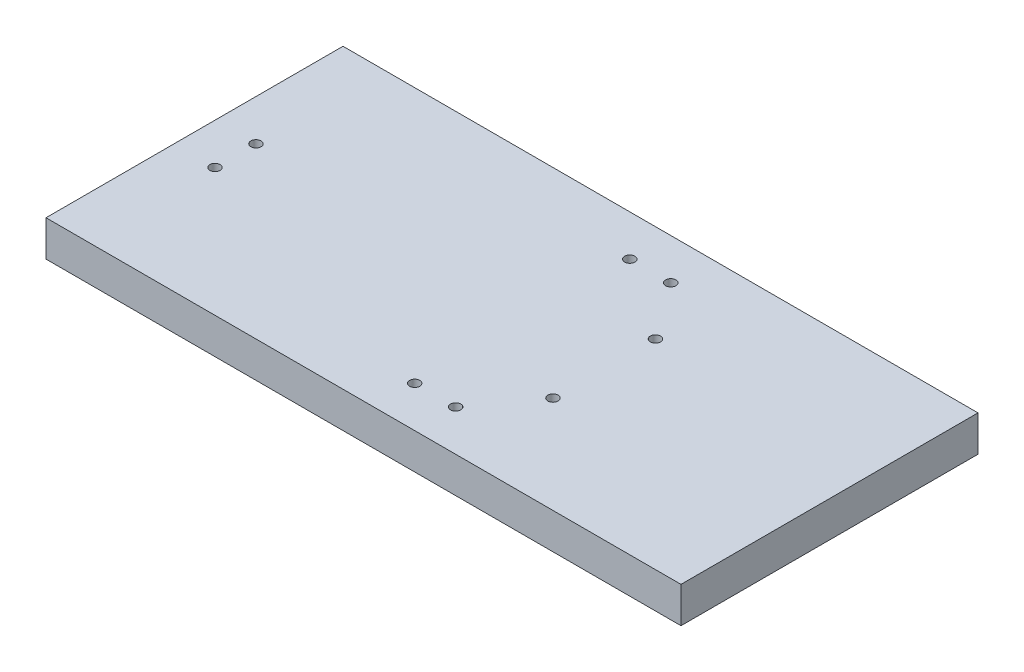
ISO-10303-21;
HEADER;
FILE_DESCRIPTION(('STEP AP214'),'2;1');
FILE_NAME('part.step','',(''),(''),'','','');
FILE_SCHEMA(('AUTOMOTIVE_DESIGN { 1 0 10303 214 1 1 1 1 }'));
ENDSEC;
DATA;
#1=APPLICATION_CONTEXT('core data for automotive mechanical design processes');
#2=APPLICATION_PROTOCOL_DEFINITION('international standard','automotive_design',2000,#1);
#3=PRODUCT_CONTEXT('',#1,'mechanical');
#4=PRODUCT('Part','Part','',(#3));
#5=PRODUCT_RELATED_PRODUCT_CATEGORY('part','',(#4));
#6=PRODUCT_DEFINITION_FORMATION('','',#4);
#7=PRODUCT_DEFINITION_CONTEXT('part definition',#1,'design');
#8=PRODUCT_DEFINITION('design','',#6,#7);
#9=PRODUCT_DEFINITION_SHAPE('','',#8);
#10=(LENGTH_UNIT() NAMED_UNIT(*) SI_UNIT(.MILLI.,.METRE.));
#11=(NAMED_UNIT(*) PLANE_ANGLE_UNIT() SI_UNIT($,.RADIAN.));
#12=(NAMED_UNIT(*) SI_UNIT($,.STERADIAN.) SOLID_ANGLE_UNIT());
#13=UNCERTAINTY_MEASURE_WITH_UNIT(LENGTH_MEASURE(1.E-05),#10,'distance_accuracy_value','');
#14=(GEOMETRIC_REPRESENTATION_CONTEXT(3) GLOBAL_UNCERTAINTY_ASSIGNED_CONTEXT((#13)) GLOBAL_UNIT_ASSIGNED_CONTEXT((#10,
#11,#12)) REPRESENTATION_CONTEXT('',''));
#15=CARTESIAN_POINT('',(0.,0.,0.));
#16=DIRECTION('',(0.,0.,1.));
#17=DIRECTION('',(1.,0.,0.));
#18=AXIS2_PLACEMENT_3D('',#15,#16,#17);
#19=CARTESIAN_POINT('',(-39.2226616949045,5.55625,37.9195832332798));
#20=DIRECTION('',(0.,1.,0.));
#21=DIRECTION('',(0.,0.,1.));
#22=AXIS2_PLACEMENT_3D('',#19,#20,#21);
#23=PLANE('',#22);
#24=CARTESIAN_POINT('',(24.2773383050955,5.55625,6.96333323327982));
#25=DIRECTION('',(0.,1.,0.));
#26=DIRECTION('',(0.,0.,1.));
#27=AXIS2_PLACEMENT_3D('',#24,#25,#26);
#28=CIRCLE('',#27,0.79375);
#29=CARTESIAN_POINT('',(24.2773383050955,5.55625,7.75708323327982));
#30=VERTEX_POINT('',#29);
#31=EDGE_CURVE('E143',#30,#30,#28,.T.);
#32=ORIENTED_EDGE('',*,*,#31,.F.);
#33=EDGE_LOOP('',(#32));
#34=FACE_BOUND('',#33,.T.);
#35=CARTESIAN_POINT('',(-32.8726616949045,5.55625,11.7258332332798));
#36=DIRECTION('',(0.,1.,0.));
#37=DIRECTION('',(0.,0.,1.));
#38=AXIS2_PLACEMENT_3D('',#35,#36,#37);
#39=CIRCLE('',#38,0.79375);
#40=CARTESIAN_POINT('',(-32.8726616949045,5.55625,12.5195832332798));
#41=VERTEX_POINT('',#40);
#42=EDGE_CURVE('E131',#41,#41,#39,.T.);
#43=ORIENTED_EDGE('',*,*,#42,.F.);
#44=EDGE_LOOP('',(#43));
#45=FACE_BOUND('',#44,.T.);
#46=CARTESIAN_POINT('',(11.5773383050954,5.55625,-1.76791676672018));
#47=DIRECTION('',(0.,1.,0.));
#48=DIRECTION('',(0.,0.,1.));
#49=AXIS2_PLACEMENT_3D('',#46,#47,#48);
#50=CIRCLE('',#49,0.793749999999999);
#51=CARTESIAN_POINT('',(11.5773383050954,5.55625,-0.974166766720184));
#52=VERTEX_POINT('',#51);
#53=EDGE_CURVE('E119',#52,#52,#50,.T.);
#54=ORIENTED_EDGE('',*,*,#53,.F.);
#55=EDGE_LOOP('',(#54));
#56=FACE_BOUND('',#55,.T.);
#57=CARTESIAN_POINT('',(11.5773383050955,5.55625,31.5695832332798));
#58=DIRECTION('',(0.,1.,0.));
#59=DIRECTION('',(0.,0.,1.));
#60=AXIS2_PLACEMENT_3D('',#57,#58,#59);
#61=CIRCLE('',#60,0.793749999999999);
#62=CARTESIAN_POINT('',(11.5773383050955,5.55625,32.3633332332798));
#63=VERTEX_POINT('',#62);
#64=EDGE_CURVE('E98',#63,#63,#61,.T.);
#65=ORIENTED_EDGE('',*,*,#64,.F.);
#66=EDGE_LOOP('',(#65));
#67=FACE_BOUND('',#66,.T.);
#68=DIRECTION('',(0.,0.,1.));
#69=VECTOR('',#68,1.);
#70=CARTESIAN_POINT('',(-39.2226616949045,5.55625,-8.11791676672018));
#71=LINE('',#70,#69);
#72=CARTESIAN_POINT('',(-39.2226616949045,5.55625,-8.11791676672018));
#73=VERTEX_POINT('',#72);
#74=CARTESIAN_POINT('',(-39.2226616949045,5.55625,37.9195832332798));
#75=VERTEX_POINT('',#74);
#76=EDGE_CURVE('E83',#73,#75,#71,.T.);
#77=ORIENTED_EDGE('',*,*,#76,.T.);
#78=DIRECTION('',(1.,0.,0.));
#79=VECTOR('',#78,1.);
#80=CARTESIAN_POINT('',(-39.2226616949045,5.55625,37.9195832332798));
#81=LINE('',#80,#79);
#82=CARTESIAN_POINT('',(59.2023383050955,5.55625,37.9195832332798));
#83=VERTEX_POINT('',#82);
#84=EDGE_CURVE('E78',#75,#83,#81,.T.);
#85=ORIENTED_EDGE('',*,*,#84,.T.);
#86=DIRECTION('',(0.,0.,-1.));
#87=VECTOR('',#86,1.);
#88=CARTESIAN_POINT('',(59.2023383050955,5.55625,-8.11791676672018));
#89=LINE('',#88,#87);
#90=CARTESIAN_POINT('',(59.2023383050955,5.55625,-8.11791676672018));
#91=VERTEX_POINT('',#90);
#92=EDGE_CURVE('E81',#83,#91,#89,.T.);
#93=ORIENTED_EDGE('',*,*,#92,.T.);
#94=DIRECTION('',(-1.,0.,0.));
#95=VECTOR('',#94,1.);
#96=CARTESIAN_POINT('',(-39.2226616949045,5.55625,-8.11791676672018));
#97=LINE('',#96,#95);
#98=EDGE_CURVE('E48',#91,#73,#97,.T.);
#99=ORIENTED_EDGE('',*,*,#98,.T.);
#100=EDGE_LOOP('',(#77,#85,#93,#99));
#101=FACE_BOUND('',#100,.T.);
#102=CARTESIAN_POINT('',(17.9273383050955,5.55625,31.5695832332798));
#103=DIRECTION('',(0.,1.,0.));
#104=DIRECTION('',(0.,0.,1.));
#105=AXIS2_PLACEMENT_3D('',#102,#103,#104);
#106=CIRCLE('',#105,0.793749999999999);
#107=CARTESIAN_POINT('',(17.9273383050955,5.55625,32.3633332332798));
#108=VERTEX_POINT('',#107);
#109=EDGE_CURVE('E113',#108,#108,#106,.T.);
#110=ORIENTED_EDGE('',*,*,#109,.F.);
#111=EDGE_LOOP('',(#110));
#112=FACE_BOUND('',#111,.T.);
#113=CARTESIAN_POINT('',(17.9273383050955,5.55625,-1.76791676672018));
#114=DIRECTION('',(0.,1.,0.));
#115=DIRECTION('',(0.,0.,1.));
#116=AXIS2_PLACEMENT_3D('',#113,#114,#115);
#117=CIRCLE('',#116,0.793749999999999);
#118=CARTESIAN_POINT('',(17.9273383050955,5.55625,-0.974166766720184));
#119=VERTEX_POINT('',#118);
#120=EDGE_CURVE('E125',#119,#119,#117,.T.);
#121=ORIENTED_EDGE('',*,*,#120,.F.);
#122=EDGE_LOOP('',(#121));
#123=FACE_BOUND('',#122,.T.);
#124=CARTESIAN_POINT('',(24.2773383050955,5.55625,22.8383332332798));
#125=DIRECTION('',(0.,1.,0.));
#126=DIRECTION('',(0.,0.,-1.));
#127=AXIS2_PLACEMENT_3D('',#124,#125,#126);
#128=CIRCLE('',#127,0.793749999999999);
#129=CARTESIAN_POINT('',(24.2773383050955,5.55625,22.0445832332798));
#130=VERTEX_POINT('',#129);
#131=EDGE_CURVE('E137',#130,#130,#128,.T.);
#132=ORIENTED_EDGE('',*,*,#131,.F.);
#133=EDGE_LOOP('',(#132));
#134=FACE_BOUND('',#133,.T.);
#135=CARTESIAN_POINT('',(-32.8726616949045,5.55625,18.0758332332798));
#136=DIRECTION('',(0.,1.,0.));
#137=DIRECTION('',(0.,0.,-1.));
#138=AXIS2_PLACEMENT_3D('',#135,#136,#137);
#139=CIRCLE('',#138,0.793749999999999);
#140=CARTESIAN_POINT('',(-32.8726616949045,5.55625,17.2820832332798));
#141=VERTEX_POINT('',#140);
#142=EDGE_CURVE('E149',#141,#141,#139,.T.);
#143=ORIENTED_EDGE('',*,*,#142,.F.);
#144=EDGE_LOOP('',(#143));
#145=FACE_BOUND('',#144,.T.);
#146=ADVANCED_FACE('F31',(#34,#45,#56,#67,#101,#112,#123,#134,#145),#23,.T.);
#147=CARTESIAN_POINT('',(-39.2226616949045,0.,37.9195832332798));
#148=DIRECTION('',(0.,1.,0.));
#149=DIRECTION('',(0.,0.,1.));
#150=AXIS2_PLACEMENT_3D('',#147,#148,#149);
#151=PLANE('',#150);
#152=CARTESIAN_POINT('',(24.2773383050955,0.,6.96333323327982));
#153=DIRECTION('',(0.,1.,0.));
#154=DIRECTION('',(0.,0.,1.));
#155=AXIS2_PLACEMENT_3D('',#152,#153,#154);
#156=CIRCLE('',#155,0.79375);
#157=CARTESIAN_POINT('',(24.2773383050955,0.,7.75708323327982));
#158=VERTEX_POINT('',#157);
#159=EDGE_CURVE('E146',#158,#158,#156,.T.);
#160=ORIENTED_EDGE('',*,*,#159,.T.);
#161=EDGE_LOOP('',(#160));
#162=FACE_BOUND('',#161,.T.);
#163=CARTESIAN_POINT('',(-32.8726616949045,0.,11.7258332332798));
#164=DIRECTION('',(0.,1.,0.));
#165=DIRECTION('',(0.,0.,1.));
#166=AXIS2_PLACEMENT_3D('',#163,#164,#165);
#167=CIRCLE('',#166,0.79375);
#168=CARTESIAN_POINT('',(-32.8726616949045,0.,12.5195832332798));
#169=VERTEX_POINT('',#168);
#170=EDGE_CURVE('E134',#169,#169,#167,.T.);
#171=ORIENTED_EDGE('',*,*,#170,.T.);
#172=EDGE_LOOP('',(#171));
#173=FACE_BOUND('',#172,.T.);
#174=CARTESIAN_POINT('',(11.5773383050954,0.,-1.76791676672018));
#175=DIRECTION('',(0.,1.,0.));
#176=DIRECTION('',(0.,0.,1.));
#177=AXIS2_PLACEMENT_3D('',#174,#175,#176);
#178=CIRCLE('',#177,0.793749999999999);
#179=CARTESIAN_POINT('',(11.5773383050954,0.,-0.974166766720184));
#180=VERTEX_POINT('',#179);
#181=EDGE_CURVE('E122',#180,#180,#178,.T.);
#182=ORIENTED_EDGE('',*,*,#181,.T.);
#183=EDGE_LOOP('',(#182));
#184=FACE_BOUND('',#183,.T.);
#185=CARTESIAN_POINT('',(11.5773383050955,0.,31.5695832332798));
#186=DIRECTION('',(0.,1.,0.));
#187=DIRECTION('',(0.,0.,1.));
#188=AXIS2_PLACEMENT_3D('',#185,#186,#187);
#189=CIRCLE('',#188,0.793749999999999);
#190=CARTESIAN_POINT('',(11.5773383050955,0.,32.3633332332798));
#191=VERTEX_POINT('',#190);
#192=EDGE_CURVE('E110',#191,#191,#189,.T.);
#193=ORIENTED_EDGE('',*,*,#192,.T.);
#194=EDGE_LOOP('',(#193));
#195=FACE_BOUND('',#194,.T.);
#196=DIRECTION('',(0.,0.,1.));
#197=VECTOR('',#196,1.);
#198=CARTESIAN_POINT('',(-39.2226616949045,0.,-8.11791676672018));
#199=LINE('',#198,#197);
#200=CARTESIAN_POINT('',(-39.2226616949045,0.,-8.11791676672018));
#201=VERTEX_POINT('',#200);
#202=CARTESIAN_POINT('',(-39.2226616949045,0.,37.9195832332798));
#203=VERTEX_POINT('',#202);
#204=EDGE_CURVE('E95',#201,#203,#199,.T.);
#205=ORIENTED_EDGE('',*,*,#204,.F.);
#206=DIRECTION('',(-1.,0.,0.));
#207=VECTOR('',#206,1.);
#208=CARTESIAN_POINT('',(-39.2226616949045,0.,-8.11791676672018));
#209=LINE('',#208,#207);
#210=CARTESIAN_POINT('',(59.2023383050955,0.,-8.11791676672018));
#211=VERTEX_POINT('',#210);
#212=EDGE_CURVE('E71',#211,#201,#209,.T.);
#213=ORIENTED_EDGE('',*,*,#212,.F.);
#214=DIRECTION('',(0.,0.,-1.));
#215=VECTOR('',#214,1.);
#216=CARTESIAN_POINT('',(59.2023383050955,0.,-8.11791676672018));
#217=LINE('',#216,#215);
#218=CARTESIAN_POINT('',(59.2023383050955,0.,37.9195832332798));
#219=VERTEX_POINT('',#218);
#220=EDGE_CURVE('E65',#219,#211,#217,.T.);
#221=ORIENTED_EDGE('',*,*,#220,.F.);
#222=DIRECTION('',(1.,0.,0.));
#223=VECTOR('',#222,1.);
#224=CARTESIAN_POINT('',(-39.2226616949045,0.,37.9195832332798));
#225=LINE('',#224,#223);
#226=EDGE_CURVE('E87',#203,#219,#225,.T.);
#227=ORIENTED_EDGE('',*,*,#226,.F.);
#228=EDGE_LOOP('',(#205,#213,#221,#227));
#229=FACE_BOUND('',#228,.T.);
#230=CARTESIAN_POINT('',(17.9273383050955,0.,31.5695832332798));
#231=DIRECTION('',(0.,1.,0.));
#232=DIRECTION('',(0.,0.,1.));
#233=AXIS2_PLACEMENT_3D('',#230,#231,#232);
#234=CIRCLE('',#233,0.793749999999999);
#235=CARTESIAN_POINT('',(17.9273383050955,0.,32.3633332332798));
#236=VERTEX_POINT('',#235);
#237=EDGE_CURVE('E116',#236,#236,#234,.T.);
#238=ORIENTED_EDGE('',*,*,#237,.T.);
#239=EDGE_LOOP('',(#238));
#240=FACE_BOUND('',#239,.T.);
#241=CARTESIAN_POINT('',(17.9273383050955,0.,-1.76791676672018));
#242=DIRECTION('',(0.,1.,0.));
#243=DIRECTION('',(0.,0.,1.));
#244=AXIS2_PLACEMENT_3D('',#241,#242,#243);
#245=CIRCLE('',#244,0.793749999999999);
#246=CARTESIAN_POINT('',(17.9273383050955,0.,-0.974166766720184));
#247=VERTEX_POINT('',#246);
#248=EDGE_CURVE('E128',#247,#247,#245,.T.);
#249=ORIENTED_EDGE('',*,*,#248,.T.);
#250=EDGE_LOOP('',(#249));
#251=FACE_BOUND('',#250,.T.);
#252=CARTESIAN_POINT('',(24.2773383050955,0.,22.8383332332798));
#253=DIRECTION('',(0.,1.,0.));
#254=DIRECTION('',(0.,0.,-1.));
#255=AXIS2_PLACEMENT_3D('',#252,#253,#254);
#256=CIRCLE('',#255,0.793749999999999);
#257=CARTESIAN_POINT('',(24.2773383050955,0.,22.0445832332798));
#258=VERTEX_POINT('',#257);
#259=EDGE_CURVE('E140',#258,#258,#256,.T.);
#260=ORIENTED_EDGE('',*,*,#259,.T.);
#261=EDGE_LOOP('',(#260));
#262=FACE_BOUND('',#261,.T.);
#263=CARTESIAN_POINT('',(-32.8726616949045,0.,18.0758332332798));
#264=DIRECTION('',(0.,1.,0.));
#265=DIRECTION('',(0.,0.,-1.));
#266=AXIS2_PLACEMENT_3D('',#263,#264,#265);
#267=CIRCLE('',#266,0.793749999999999);
#268=CARTESIAN_POINT('',(-32.8726616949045,0.,17.2820832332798));
#269=VERTEX_POINT('',#268);
#270=EDGE_CURVE('E152',#269,#269,#267,.T.);
#271=ORIENTED_EDGE('',*,*,#270,.T.);
#272=EDGE_LOOP('',(#271));
#273=FACE_BOUND('',#272,.T.);
#274=ADVANCED_FACE('F106',(#162,#173,#184,#195,#229,#240,#251,#262,#273),#151,.F.);
#275=CARTESIAN_POINT('',(-39.2226616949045,5.55625,-8.11791676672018));
#276=DIRECTION('',(1.,0.,0.));
#277=DIRECTION('',(0.,0.,-1.));
#278=AXIS2_PLACEMENT_3D('',#275,#276,#277);
#279=PLANE('',#278);
#280=ORIENTED_EDGE('',*,*,#204,.T.);
#281=DIRECTION('',(0.,-1.,0.));
#282=VECTOR('',#281,1.);
#283=CARTESIAN_POINT('',(-39.2226616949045,5.55625,37.9195832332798));
#284=LINE('',#283,#282);
#285=EDGE_CURVE('E11',#75,#203,#284,.T.);
#286=ORIENTED_EDGE('',*,*,#285,.F.);
#287=ORIENTED_EDGE('',*,*,#76,.F.);
#288=DIRECTION('',(0.,-1.,0.));
#289=VECTOR('',#288,1.);
#290=CARTESIAN_POINT('',(-39.2226616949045,5.55625,-8.11791676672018));
#291=LINE('',#290,#289);
#292=EDGE_CURVE('E91',#73,#201,#291,.T.);
#293=ORIENTED_EDGE('',*,*,#292,.T.);
#294=EDGE_LOOP('',(#280,#286,#287,#293));
#295=FACE_BOUND('',#294,.T.);
#296=ADVANCED_FACE('F33',(#295),#279,.F.);
#297=CARTESIAN_POINT('',(-39.2226616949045,5.55625,37.9195832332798));
#298=DIRECTION('',(0.,0.,-1.));
#299=DIRECTION('',(-1.,0.,0.));
#300=AXIS2_PLACEMENT_3D('',#297,#298,#299);
#301=PLANE('',#300);
#302=ORIENTED_EDGE('',*,*,#226,.T.);
#303=DIRECTION('',(0.,-1.,0.));
#304=VECTOR('',#303,1.);
#305=CARTESIAN_POINT('',(59.2023383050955,5.55625,37.9195832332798));
#306=LINE('',#305,#304);
#307=EDGE_CURVE('E40',#83,#219,#306,.T.);
#308=ORIENTED_EDGE('',*,*,#307,.F.);
#309=ORIENTED_EDGE('',*,*,#84,.F.);
#310=ORIENTED_EDGE('',*,*,#285,.T.);
#311=EDGE_LOOP('',(#302,#308,#309,#310));
#312=FACE_BOUND('',#311,.T.);
#313=ADVANCED_FACE('F86',(#312),#301,.F.);
#314=CARTESIAN_POINT('',(59.2023383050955,5.55625,-8.11791676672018));
#315=DIRECTION('',(-1.,0.,0.));
#316=DIRECTION('',(0.,0.,1.));
#317=AXIS2_PLACEMENT_3D('',#314,#315,#316);
#318=PLANE('',#317);
#319=ORIENTED_EDGE('',*,*,#220,.T.);
#320=DIRECTION('',(0.,-1.,0.));
#321=VECTOR('',#320,1.);
#322=CARTESIAN_POINT('',(59.2023383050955,5.55625,-8.11791676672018));
#323=LINE('',#322,#321);
#324=EDGE_CURVE('E88',#91,#211,#323,.T.);
#325=ORIENTED_EDGE('',*,*,#324,.F.);
#326=ORIENTED_EDGE('',*,*,#92,.F.);
#327=ORIENTED_EDGE('',*,*,#307,.T.);
#328=EDGE_LOOP('',(#319,#325,#326,#327));
#329=FACE_BOUND('',#328,.T.);
#330=ADVANCED_FACE('F89',(#329),#318,.F.);
#331=CARTESIAN_POINT('',(-39.2226616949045,5.55625,-8.11791676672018));
#332=DIRECTION('',(0.,0.,1.));
#333=DIRECTION('',(1.,0.,0.));
#334=AXIS2_PLACEMENT_3D('',#331,#332,#333);
#335=PLANE('',#334);
#336=ORIENTED_EDGE('',*,*,#212,.T.);
#337=ORIENTED_EDGE('',*,*,#292,.F.);
#338=ORIENTED_EDGE('',*,*,#98,.F.);
#339=ORIENTED_EDGE('',*,*,#324,.T.);
#340=EDGE_LOOP('',(#336,#337,#338,#339));
#341=FACE_BOUND('',#340,.T.);
#342=ADVANCED_FACE('F103',(#341),#335,.F.);
#343=CARTESIAN_POINT('',(11.5773383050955,5.55625,31.5695832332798));
#344=DIRECTION('',(0.,-1.,0.));
#345=DIRECTION('',(0.,0.,-1.));
#346=AXIS2_PLACEMENT_3D('',#343,#344,#345);
#347=CYLINDRICAL_SURFACE('',#346,0.793749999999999);
#348=ORIENTED_EDGE('',*,*,#64,.T.);
#349=EDGE_LOOP('',(#348));
#350=FACE_BOUND('',#349,.T.);
#351=ORIENTED_EDGE('',*,*,#192,.F.);
#352=EDGE_LOOP('',(#351));
#353=FACE_BOUND('',#352,.T.);
#354=ADVANCED_FACE('F172',(#350,#353),#347,.F.);
#355=CARTESIAN_POINT('',(17.9273383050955,5.55625,31.5695832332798));
#356=DIRECTION('',(0.,-1.,0.));
#357=DIRECTION('',(0.,0.,-1.));
#358=AXIS2_PLACEMENT_3D('',#355,#356,#357);
#359=CYLINDRICAL_SURFACE('',#358,0.793749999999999);
#360=ORIENTED_EDGE('',*,*,#109,.T.);
#361=EDGE_LOOP('',(#360));
#362=FACE_BOUND('',#361,.T.);
#363=ORIENTED_EDGE('',*,*,#237,.F.);
#364=EDGE_LOOP('',(#363));
#365=FACE_BOUND('',#364,.T.);
#366=ADVANCED_FACE('F218',(#362,#365),#359,.F.);
#367=CARTESIAN_POINT('',(11.5773383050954,5.55625,-1.76791676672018));
#368=DIRECTION('',(0.,-1.,0.));
#369=DIRECTION('',(0.,0.,-1.));
#370=AXIS2_PLACEMENT_3D('',#367,#368,#369);
#371=CYLINDRICAL_SURFACE('',#370,0.793749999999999);
#372=ORIENTED_EDGE('',*,*,#53,.T.);
#373=EDGE_LOOP('',(#372));
#374=FACE_BOUND('',#373,.T.);
#375=ORIENTED_EDGE('',*,*,#181,.F.);
#376=EDGE_LOOP('',(#375));
#377=FACE_BOUND('',#376,.T.);
#378=ADVANCED_FACE('F226',(#374,#377),#371,.F.);
#379=CARTESIAN_POINT('',(17.9273383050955,5.55625,-1.76791676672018));
#380=DIRECTION('',(0.,-1.,0.));
#381=DIRECTION('',(0.,0.,-1.));
#382=AXIS2_PLACEMENT_3D('',#379,#380,#381);
#383=CYLINDRICAL_SURFACE('',#382,0.793749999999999);
#384=ORIENTED_EDGE('',*,*,#120,.T.);
#385=EDGE_LOOP('',(#384));
#386=FACE_BOUND('',#385,.T.);
#387=ORIENTED_EDGE('',*,*,#248,.F.);
#388=EDGE_LOOP('',(#387));
#389=FACE_BOUND('',#388,.T.);
#390=ADVANCED_FACE('F234',(#386,#389),#383,.F.);
#391=CARTESIAN_POINT('',(-32.8726616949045,5.55625,11.7258332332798));
#392=DIRECTION('',(0.,-1.,0.));
#393=DIRECTION('',(0.,0.,-1.));
#394=AXIS2_PLACEMENT_3D('',#391,#392,#393);
#395=CYLINDRICAL_SURFACE('',#394,0.79375);
#396=ORIENTED_EDGE('',*,*,#42,.T.);
#397=EDGE_LOOP('',(#396));
#398=FACE_BOUND('',#397,.T.);
#399=ORIENTED_EDGE('',*,*,#170,.F.);
#400=EDGE_LOOP('',(#399));
#401=FACE_BOUND('',#400,.T.);
#402=ADVANCED_FACE('F243',(#398,#401),#395,.F.);
#403=CARTESIAN_POINT('',(24.2773383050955,5.55625,22.8383332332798));
#404=DIRECTION('',(0.,-1.,0.));
#405=DIRECTION('',(0.,0.,-1.));
#406=AXIS2_PLACEMENT_3D('',#403,#404,#405);
#407=CYLINDRICAL_SURFACE('',#406,0.793749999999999);
#408=ORIENTED_EDGE('',*,*,#131,.T.);
#409=EDGE_LOOP('',(#408));
#410=FACE_BOUND('',#409,.T.);
#411=ORIENTED_EDGE('',*,*,#259,.F.);
#412=EDGE_LOOP('',(#411));
#413=FACE_BOUND('',#412,.T.);
#414=ADVANCED_FACE('F252',(#410,#413),#407,.F.);
#415=CARTESIAN_POINT('',(24.2773383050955,5.55625,6.96333323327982));
#416=DIRECTION('',(0.,-1.,0.));
#417=DIRECTION('',(0.,0.,-1.));
#418=AXIS2_PLACEMENT_3D('',#415,#416,#417);
#419=CYLINDRICAL_SURFACE('',#418,0.79375);
#420=ORIENTED_EDGE('',*,*,#31,.T.);
#421=EDGE_LOOP('',(#420));
#422=FACE_BOUND('',#421,.T.);
#423=ORIENTED_EDGE('',*,*,#159,.F.);
#424=EDGE_LOOP('',(#423));
#425=FACE_BOUND('',#424,.T.);
#426=ADVANCED_FACE('F261',(#422,#425),#419,.F.);
#427=CARTESIAN_POINT('',(-32.8726616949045,5.55625,18.0758332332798));
#428=DIRECTION('',(0.,-1.,0.));
#429=DIRECTION('',(0.,0.,-1.));
#430=AXIS2_PLACEMENT_3D('',#427,#428,#429);
#431=CYLINDRICAL_SURFACE('',#430,0.793749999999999);
#432=ORIENTED_EDGE('',*,*,#142,.T.);
#433=EDGE_LOOP('',(#432));
#434=FACE_BOUND('',#433,.T.);
#435=ORIENTED_EDGE('',*,*,#270,.F.);
#436=EDGE_LOOP('',(#435));
#437=FACE_BOUND('',#436,.T.);
#438=ADVANCED_FACE('F158',(#434,#437),#431,.F.);
#439=CLOSED_SHELL('',(#146,#274,#296,#313,#330,#342,#354,#366,#378,#390,#402,#414,#426,#438));
#440=MANIFOLD_SOLID_BREP('B2',#439);
#441=ADVANCED_BREP_SHAPE_REPRESENTATION('',(#18,#440),#14);
#442=SHAPE_DEFINITION_REPRESENTATION(#9,#441);
ENDSEC;
END-ISO-10303-21;
